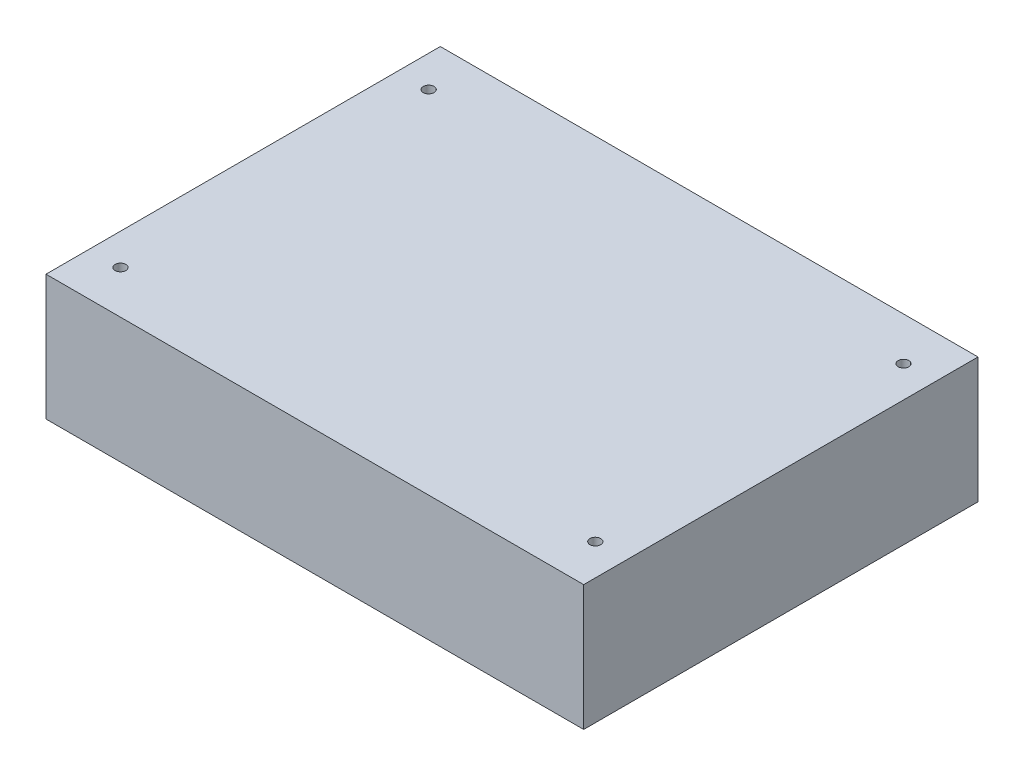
ISO-10303-21;
HEADER;
FILE_DESCRIPTION(('STEP AP214'),'2;1');
FILE_NAME('part.step','',(''),(''),'','','');
FILE_SCHEMA(('AUTOMOTIVE_DESIGN { 1 0 10303 214 1 1 1 1 }'));
ENDSEC;
DATA;
#1=APPLICATION_CONTEXT('core data for automotive mechanical design processes');
#2=APPLICATION_PROTOCOL_DEFINITION('international standard','automotive_design',2000,#1);
#3=PRODUCT_CONTEXT('',#1,'mechanical');
#4=PRODUCT('Part','Part','',(#3));
#5=PRODUCT_RELATED_PRODUCT_CATEGORY('part','',(#4));
#6=PRODUCT_DEFINITION_FORMATION('','',#4);
#7=PRODUCT_DEFINITION_CONTEXT('part definition',#1,'design');
#8=PRODUCT_DEFINITION('design','',#6,#7);
#9=PRODUCT_DEFINITION_SHAPE('','',#8);
#10=(LENGTH_UNIT() NAMED_UNIT(*) SI_UNIT(.MILLI.,.METRE.));
#11=(NAMED_UNIT(*) PLANE_ANGLE_UNIT() SI_UNIT($,.RADIAN.));
#12=(NAMED_UNIT(*) SI_UNIT($,.STERADIAN.) SOLID_ANGLE_UNIT());
#13=UNCERTAINTY_MEASURE_WITH_UNIT(LENGTH_MEASURE(1.E-05),#10,'distance_accuracy_value','');
#14=(GEOMETRIC_REPRESENTATION_CONTEXT(3) GLOBAL_UNCERTAINTY_ASSIGNED_CONTEXT((#13)) GLOBAL_UNIT_ASSIGNED_CONTEXT((#10,
#11,#12)) REPRESENTATION_CONTEXT('',''));
#15=CARTESIAN_POINT('',(0.,0.,0.));
#16=DIRECTION('',(0.,0.,1.));
#17=DIRECTION('',(1.,0.,0.));
#18=AXIS2_PLACEMENT_3D('',#15,#16,#17);
#19=CARTESIAN_POINT('',(75.,35.,55.));
#20=DIRECTION('',(-1.,0.,0.));
#21=DIRECTION('',(0.,0.,1.));
#22=AXIS2_PLACEMENT_3D('',#19,#20,#21);
#23=PLANE('',#22);
#24=DIRECTION('',(0.,0.,-1.));
#25=VECTOR('',#24,1.);
#26=CARTESIAN_POINT('',(75.,0.,55.));
#27=LINE('',#26,#25);
#28=CARTESIAN_POINT('',(75.,0.,55.));
#29=VERTEX_POINT('',#28);
#30=CARTESIAN_POINT('',(75.,0.,-55.));
#31=VERTEX_POINT('',#30);
#32=EDGE_CURVE('E114',#29,#31,#27,.T.);
#33=ORIENTED_EDGE('',*,*,#32,.T.);
#34=DIRECTION('',(0.,-1.,0.));
#35=VECTOR('',#34,1.);
#36=CARTESIAN_POINT('',(75.,35.,-55.));
#37=LINE('',#36,#35);
#38=CARTESIAN_POINT('',(75.,35.,-55.));
#39=VERTEX_POINT('',#38);
#40=EDGE_CURVE('E11',#39,#31,#37,.T.);
#41=ORIENTED_EDGE('',*,*,#40,.F.);
#42=DIRECTION('',(0.,0.,-1.));
#43=VECTOR('',#42,1.);
#44=CARTESIAN_POINT('',(75.,35.,55.));
#45=LINE('',#44,#43);
#46=CARTESIAN_POINT('',(75.,35.,55.));
#47=VERTEX_POINT('',#46);
#48=EDGE_CURVE('E98',#47,#39,#45,.T.);
#49=ORIENTED_EDGE('',*,*,#48,.F.);
#50=DIRECTION('',(0.,-1.,0.));
#51=VECTOR('',#50,1.);
#52=CARTESIAN_POINT('',(75.,35.,55.));
#53=LINE('',#52,#51);
#54=EDGE_CURVE('E110',#47,#29,#53,.T.);
#55=ORIENTED_EDGE('',*,*,#54,.T.);
#56=EDGE_LOOP('',(#33,#41,#49,#55));
#57=FACE_BOUND('',#56,.T.);
#58=ADVANCED_FACE('F46',(#57),#23,.F.);
#59=CARTESIAN_POINT('',(-75.,35.,-55.));
#60=DIRECTION('',(0.,0.,1.));
#61=DIRECTION('',(1.,0.,0.));
#62=AXIS2_PLACEMENT_3D('',#59,#60,#61);
#63=PLANE('',#62);
#64=DIRECTION('',(-1.,0.,0.));
#65=VECTOR('',#64,1.);
#66=CARTESIAN_POINT('',(-75.,0.,-55.));
#67=LINE('',#66,#65);
#68=CARTESIAN_POINT('',(-75.,0.,-55.));
#69=VERTEX_POINT('',#68);
#70=EDGE_CURVE('E103',#31,#69,#67,.T.);
#71=ORIENTED_EDGE('',*,*,#70,.T.);
#72=DIRECTION('',(0.,-1.,0.));
#73=VECTOR('',#72,1.);
#74=CARTESIAN_POINT('',(-75.,35.,-55.));
#75=LINE('',#74,#73);
#76=CARTESIAN_POINT('',(-75.,35.,-55.));
#77=VERTEX_POINT('',#76);
#78=EDGE_CURVE('E55',#77,#69,#75,.T.);
#79=ORIENTED_EDGE('',*,*,#78,.F.);
#80=DIRECTION('',(-1.,0.,0.));
#81=VECTOR('',#80,1.);
#82=CARTESIAN_POINT('',(-75.,35.,-55.));
#83=LINE('',#82,#81);
#84=EDGE_CURVE('E93',#39,#77,#83,.T.);
#85=ORIENTED_EDGE('',*,*,#84,.F.);
#86=ORIENTED_EDGE('',*,*,#40,.T.);
#87=EDGE_LOOP('',(#71,#79,#85,#86));
#88=FACE_BOUND('',#87,.T.);
#89=ADVANCED_FACE('F102',(#88),#63,.F.);
#90=CARTESIAN_POINT('',(-75.,35.,55.));
#91=DIRECTION('',(1.,0.,0.));
#92=DIRECTION('',(0.,0.,-1.));
#93=AXIS2_PLACEMENT_3D('',#90,#91,#92);
#94=PLANE('',#93);
#95=DIRECTION('',(0.,0.,1.));
#96=VECTOR('',#95,1.);
#97=CARTESIAN_POINT('',(-75.,0.,55.));
#98=LINE('',#97,#96);
#99=CARTESIAN_POINT('',(-75.,0.,55.));
#100=VERTEX_POINT('',#99);
#101=EDGE_CURVE('E80',#69,#100,#98,.T.);
#102=ORIENTED_EDGE('',*,*,#101,.T.);
#103=DIRECTION('',(0.,-1.,0.));
#104=VECTOR('',#103,1.);
#105=CARTESIAN_POINT('',(-75.,35.,55.));
#106=LINE('',#105,#104);
#107=CARTESIAN_POINT('',(-75.,35.,55.));
#108=VERTEX_POINT('',#107);
#109=EDGE_CURVE('E105',#108,#100,#106,.T.);
#110=ORIENTED_EDGE('',*,*,#109,.F.);
#111=DIRECTION('',(0.,0.,1.));
#112=VECTOR('',#111,1.);
#113=CARTESIAN_POINT('',(-75.,35.,55.));
#114=LINE('',#113,#112);
#115=EDGE_CURVE('E96',#77,#108,#114,.T.);
#116=ORIENTED_EDGE('',*,*,#115,.F.);
#117=ORIENTED_EDGE('',*,*,#78,.T.);
#118=EDGE_LOOP('',(#102,#110,#116,#117));
#119=FACE_BOUND('',#118,.T.);
#120=ADVANCED_FACE('F106',(#119),#94,.F.);
#121=CARTESIAN_POINT('',(-75.,35.,55.));
#122=DIRECTION('',(0.,0.,-1.));
#123=DIRECTION('',(-1.,0.,0.));
#124=AXIS2_PLACEMENT_3D('',#121,#122,#123);
#125=PLANE('',#124);
#126=DIRECTION('',(1.,0.,0.));
#127=VECTOR('',#126,1.);
#128=CARTESIAN_POINT('',(-75.,0.,55.));
#129=LINE('',#128,#127);
#130=EDGE_CURVE('E86',#100,#29,#129,.T.);
#131=ORIENTED_EDGE('',*,*,#130,.T.);
#132=ORIENTED_EDGE('',*,*,#54,.F.);
#133=DIRECTION('',(1.,0.,0.));
#134=VECTOR('',#133,1.);
#135=CARTESIAN_POINT('',(-75.,35.,55.));
#136=LINE('',#135,#134);
#137=EDGE_CURVE('E63',#108,#47,#136,.T.);
#138=ORIENTED_EDGE('',*,*,#137,.F.);
#139=ORIENTED_EDGE('',*,*,#109,.T.);
#140=EDGE_LOOP('',(#131,#132,#138,#139));
#141=FACE_BOUND('',#140,.T.);
#142=ADVANCED_FACE('F128',(#141),#125,.F.);
#143=CARTESIAN_POINT('',(0.,35.,0.));
#144=DIRECTION('',(0.,-1.,0.));
#145=DIRECTION('',(0.,0.,-1.));
#146=AXIS2_PLACEMENT_3D('',#143,#144,#145);
#147=PLANE('',#146);
#148=CARTESIAN_POINT('',(66.2305,35.,-42.9895));
#149=DIRECTION('',(0.,1.,0.));
#150=DIRECTION('',(0.,0.,1.));
#151=AXIS2_PLACEMENT_3D('',#148,#149,#150);
#152=CIRCLE('',#151,1.5);
#153=CARTESIAN_POINT('',(66.2305,35.,-41.4895));
#154=VERTEX_POINT('',#153);
#155=EDGE_CURVE('E147',#154,#154,#152,.T.);
#156=ORIENTED_EDGE('',*,*,#155,.F.);
#157=EDGE_LOOP('',(#156));
#158=FACE_BOUND('',#157,.T.);
#159=CARTESIAN_POINT('',(66.2305,35.,42.9895));
#160=DIRECTION('',(0.,1.,0.));
#161=DIRECTION('',(0.,0.,1.));
#162=AXIS2_PLACEMENT_3D('',#159,#160,#161);
#163=CIRCLE('',#162,1.5);
#164=CARTESIAN_POINT('',(66.2305,35.,44.4895));
#165=VERTEX_POINT('',#164);
#166=EDGE_CURVE('E155',#165,#165,#163,.T.);
#167=ORIENTED_EDGE('',*,*,#166,.F.);
#168=EDGE_LOOP('',(#167));
#169=FACE_BOUND('',#168,.T.);
#170=CARTESIAN_POINT('',(-66.2305,35.,42.9895));
#171=DIRECTION('',(0.,1.,0.));
#172=DIRECTION('',(0.,0.,1.));
#173=AXIS2_PLACEMENT_3D('',#170,#171,#172);
#174=CIRCLE('',#173,1.5);
#175=CARTESIAN_POINT('',(-66.2305,35.,44.4895));
#176=VERTEX_POINT('',#175);
#177=EDGE_CURVE('E139',#176,#176,#174,.T.);
#178=ORIENTED_EDGE('',*,*,#177,.F.);
#179=EDGE_LOOP('',(#178));
#180=FACE_BOUND('',#179,.T.);
#181=CARTESIAN_POINT('',(-66.2305,35.,-42.9895));
#182=DIRECTION('',(0.,1.,0.));
#183=DIRECTION('',(0.,0.,1.));
#184=AXIS2_PLACEMENT_3D('',#181,#182,#183);
#185=CIRCLE('',#184,1.5);
#186=CARTESIAN_POINT('',(-66.2305,35.,-41.4895));
#187=VERTEX_POINT('',#186);
#188=EDGE_CURVE('E135',#187,#187,#185,.T.);
#189=ORIENTED_EDGE('',*,*,#188,.F.);
#190=EDGE_LOOP('',(#189));
#191=FACE_BOUND('',#190,.T.);
#192=ORIENTED_EDGE('',*,*,#48,.T.);
#193=ORIENTED_EDGE('',*,*,#84,.T.);
#194=ORIENTED_EDGE('',*,*,#115,.T.);
#195=ORIENTED_EDGE('',*,*,#137,.T.);
#196=EDGE_LOOP('',(#192,#193,#194,#195));
#197=FACE_BOUND('',#196,.T.);
#198=ADVANCED_FACE('F94',(#158,#169,#180,#191,#197),#147,.F.);
#199=CARTESIAN_POINT('',(0.,0.,0.));
#200=DIRECTION('',(0.,-1.,0.));
#201=DIRECTION('',(0.,0.,-1.));
#202=AXIS2_PLACEMENT_3D('',#199,#200,#201);
#203=PLANE('',#202);
#204=CARTESIAN_POINT('',(66.2305,0.,-42.9895));
#205=DIRECTION('',(0.,1.,0.));
#206=DIRECTION('',(0.,0.,1.));
#207=AXIS2_PLACEMENT_3D('',#204,#205,#206);
#208=CIRCLE('',#207,1.5);
#209=CARTESIAN_POINT('',(66.2305,0.,-41.4895));
#210=VERTEX_POINT('',#209);
#211=EDGE_CURVE('E143',#210,#210,#208,.T.);
#212=ORIENTED_EDGE('',*,*,#211,.T.);
#213=EDGE_LOOP('',(#212));
#214=FACE_BOUND('',#213,.T.);
#215=CARTESIAN_POINT('',(66.2305,0.,42.9895));
#216=DIRECTION('',(0.,1.,0.));
#217=DIRECTION('',(0.,0.,1.));
#218=AXIS2_PLACEMENT_3D('',#215,#216,#217);
#219=CIRCLE('',#218,1.5);
#220=CARTESIAN_POINT('',(66.2305,0.,44.4895));
#221=VERTEX_POINT('',#220);
#222=EDGE_CURVE('E151',#221,#221,#219,.T.);
#223=ORIENTED_EDGE('',*,*,#222,.T.);
#224=EDGE_LOOP('',(#223));
#225=FACE_BOUND('',#224,.T.);
#226=CARTESIAN_POINT('',(-66.2305,0.,42.9895));
#227=DIRECTION('',(0.,1.,0.));
#228=DIRECTION('',(0.,0.,1.));
#229=AXIS2_PLACEMENT_3D('',#226,#227,#228);
#230=CIRCLE('',#229,1.5);
#231=CARTESIAN_POINT('',(-66.2305,0.,44.4895));
#232=VERTEX_POINT('',#231);
#233=EDGE_CURVE('E159',#232,#232,#230,.T.);
#234=ORIENTED_EDGE('',*,*,#233,.T.);
#235=EDGE_LOOP('',(#234));
#236=FACE_BOUND('',#235,.T.);
#237=CARTESIAN_POINT('',(-66.2305,0.,-42.9895));
#238=DIRECTION('',(0.,1.,0.));
#239=DIRECTION('',(0.,0.,1.));
#240=AXIS2_PLACEMENT_3D('',#237,#238,#239);
#241=CIRCLE('',#240,1.5);
#242=CARTESIAN_POINT('',(-66.2305,0.,-41.4895));
#243=VERTEX_POINT('',#242);
#244=EDGE_CURVE('E118',#243,#243,#241,.T.);
#245=ORIENTED_EDGE('',*,*,#244,.T.);
#246=EDGE_LOOP('',(#245));
#247=FACE_BOUND('',#246,.T.);
#248=ORIENTED_EDGE('',*,*,#32,.F.);
#249=ORIENTED_EDGE('',*,*,#130,.F.);
#250=ORIENTED_EDGE('',*,*,#101,.F.);
#251=ORIENTED_EDGE('',*,*,#70,.F.);
#252=EDGE_LOOP('',(#248,#249,#250,#251));
#253=FACE_BOUND('',#252,.T.);
#254=ADVANCED_FACE('F131',(#214,#225,#236,#247,#253),#203,.T.);
#255=CARTESIAN_POINT('',(-66.2305,0.,-42.9895));
#256=DIRECTION('',(0.,1.,0.));
#257=DIRECTION('',(0.,0.,1.));
#258=AXIS2_PLACEMENT_3D('',#255,#256,#257);
#259=CYLINDRICAL_SURFACE('',#258,1.5);
#260=ORIENTED_EDGE('',*,*,#244,.F.);
#261=EDGE_LOOP('',(#260));
#262=FACE_BOUND('',#261,.T.);
#263=ORIENTED_EDGE('',*,*,#188,.T.);
#264=EDGE_LOOP('',(#263));
#265=FACE_BOUND('',#264,.T.);
#266=ADVANCED_FACE('F175',(#262,#265),#259,.F.);
#267=CARTESIAN_POINT('',(-66.2305,0.,42.9895));
#268=DIRECTION('',(0.,1.,0.));
#269=DIRECTION('',(0.,0.,1.));
#270=AXIS2_PLACEMENT_3D('',#267,#268,#269);
#271=CYLINDRICAL_SURFACE('',#270,1.5);
#272=ORIENTED_EDGE('',*,*,#233,.F.);
#273=EDGE_LOOP('',(#272));
#274=FACE_BOUND('',#273,.T.);
#275=ORIENTED_EDGE('',*,*,#177,.T.);
#276=EDGE_LOOP('',(#275));
#277=FACE_BOUND('',#276,.T.);
#278=ADVANCED_FACE('F167',(#274,#277),#271,.F.);
#279=CARTESIAN_POINT('',(66.2305,0.,42.9895));
#280=DIRECTION('',(0.,1.,0.));
#281=DIRECTION('',(0.,0.,1.));
#282=AXIS2_PLACEMENT_3D('',#279,#280,#281);
#283=CYLINDRICAL_SURFACE('',#282,1.5);
#284=ORIENTED_EDGE('',*,*,#222,.F.);
#285=EDGE_LOOP('',(#284));
#286=FACE_BOUND('',#285,.T.);
#287=ORIENTED_EDGE('',*,*,#166,.T.);
#288=EDGE_LOOP('',(#287));
#289=FACE_BOUND('',#288,.T.);
#290=ADVANCED_FACE('F183',(#286,#289),#283,.F.);
#291=CARTESIAN_POINT('',(66.2305,0.,-42.9895));
#292=DIRECTION('',(0.,1.,0.));
#293=DIRECTION('',(0.,0.,1.));
#294=AXIS2_PLACEMENT_3D('',#291,#292,#293);
#295=CYLINDRICAL_SURFACE('',#294,1.5);
#296=ORIENTED_EDGE('',*,*,#211,.F.);
#297=EDGE_LOOP('',(#296));
#298=FACE_BOUND('',#297,.T.);
#299=ORIENTED_EDGE('',*,*,#155,.T.);
#300=EDGE_LOOP('',(#299));
#301=FACE_BOUND('',#300,.T.);
#302=ADVANCED_FACE('F234',(#298,#301),#295,.F.);
#303=CLOSED_SHELL('',(#58,#89,#120,#142,#198,#254,#266,#278,#290,#302));
#304=MANIFOLD_SOLID_BREP('B2',#303);
#305=ADVANCED_BREP_SHAPE_REPRESENTATION('',(#18,#304),#14);
#306=SHAPE_DEFINITION_REPRESENTATION(#9,#305);
ENDSEC;
END-ISO-10303-21;
